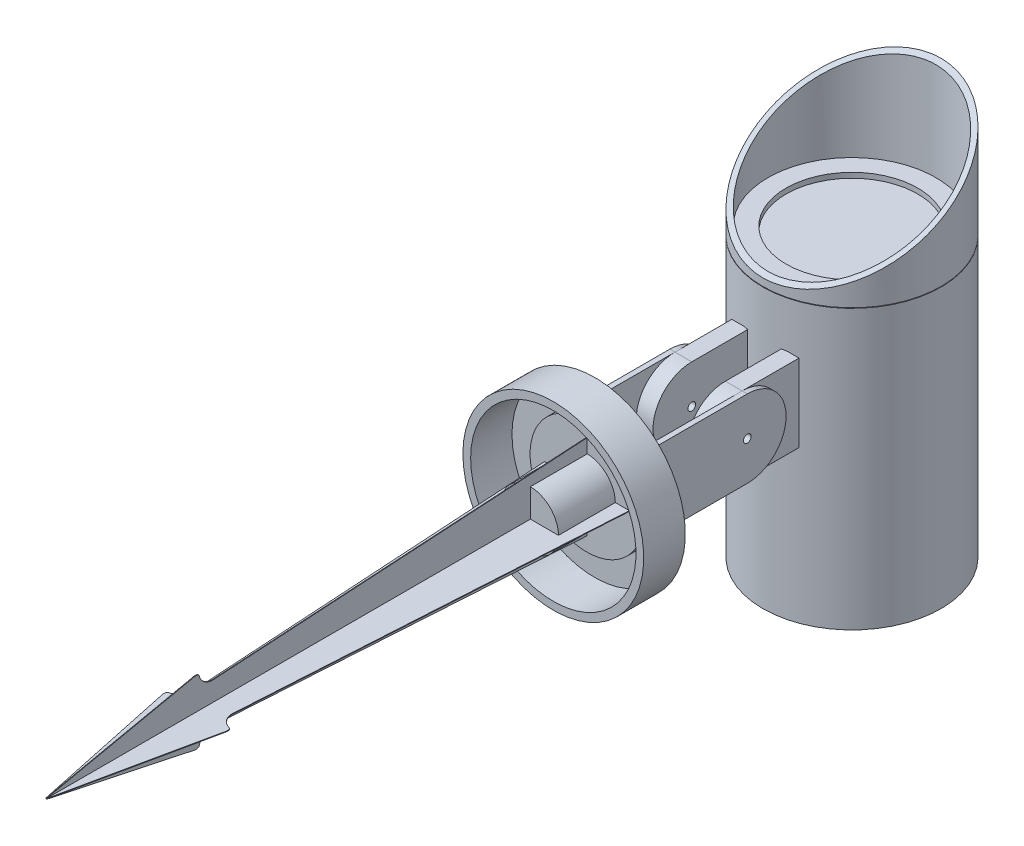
from build123d import *

# Parameters (mm, degrees)
CROQUIS1_R                    = 22
SALIENTE_EXTRUIR1_DEPTH       = 3
CROQUIS3_R                    = 11
SALIENTE_EXTRUIR2_DEPTH       = 22
SALIENTE_EXTRUIR3_DEPTH       = 0.125
MATRIZC1_COUNT                = 4
CROQUIS5_R                    = 35
CROQUIS5_R_2                  = 32
SALIENTE_EXTRUIR5_DEPTH       = 16
CROQUIS6_R                    = 35
SALIENTE_EXTRUIR6_DEPTH       = 0.1
CROQUIS7_W                    = 30
CROQUIS7_H                    = 30
SALIENTE_EXTRUIR7_DEPTH       = 2
SALIENTE_EXTRUIR8_DEPTH       = 2
SALIENTE_EXTRUIR9_DEPTH       = 6.5
CROQUIS12_R                   = 1.5
CORTAR_EXTRUIR1_DEPTH         = 221.83849469
SALIENTE_EXTRUIR10_DEPTH      = 75
SALIENTE_EXTRUIR10_DEPTH_BACK = 75
CROQUIS13_R                   = 34.5
CROQUIS14_R                   = 32.5
CORTAR_EXTRUIR2_DEPTH         = 39
CORTAR_EXTRUIR3_DEPTH         = 228.803952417
CORTAR_EXTRUIR3_DEPTH_BACK    = 228.803952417
CROQUIS16_R                   = 25.5
CORTAR_EXTRUIR4_DEPTH         = 2
CROQUIS17_R                   = 34.5
CROQUIS17_R_2                 = 32.5
CORTAR_EXTRUIR5_DEPTH         = 0.2


with BuildPart() as part:
    # Croquis1 → Saliente-Extruir1 (new body)
    with BuildSketch(Plane.XY):
        Circle(CROQUIS1_R)
    extrude(amount=SALIENTE_EXTRUIR1_DEPTH)

    # Croquis3 → Saliente-Extruir2 (add)
    with BuildSketch(Plane.XY.offset(3)):
        Circle(CROQUIS3_R)
    extrude(amount=SALIENTE_EXTRUIR2_DEPTH)

    # Croquis4 → Saliente-Extruir3 (add, symmetric)
    with BuildSketch(Plane(origin=(0, 0, 0), x_dir=(1, 0, 0), z_dir=(0, 1, 0))):
        with BuildLine():
            Line((-16.438389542, -3), (16.438389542, -3))
            Line((16.438389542, -3), (7.650010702, -147.998401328))
            ThreePointArc((7.650010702, -147.998401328), (8.754363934, -151.251708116), (11.610998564, -153.160435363))
            ThreePointArc((11.610998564, -153.160435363), (12.100186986, -153.462666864), (12.342048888, -153.984348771))
            ThreePointArc((12.342048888, -153.984348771), (12.358637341, -154.898924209), (12.149581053, -155.789440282))
            Line((12.149581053, -155.789440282), (0.195637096, -212.078774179))
            ThreePointArc((0.195637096, -212.078774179), (0, -212.2372275), (-0.195637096, -212.078774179))
            Line((-0.195637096, -212.078774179), (-12.149581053, -155.789440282))
            ThreePointArc((-12.149581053, -155.789440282), (-12.358637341, -154.898924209), (-12.342048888, -153.984348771))
            ThreePointArc((-12.342048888, -153.984348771), (-12.100186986, -153.462666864), (-11.610998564, -153.160435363))
            ThreePointArc((-11.610998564, -153.160435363), (-8.754363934, -151.251708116), (-7.650010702, -147.998401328))
            Line((-7.650010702, -147.998401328), (-16.438389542, -3))
        make_face()
    saliente_extruir3 = extrude(amount=SALIENTE_EXTRUIR3_DEPTH, both=True)

    # MatrizC1: Saliente-Extruir3 ×4 about axis
    matrizc1_axis = Axis((0, 0, 0), (0, 0, 1))
    for i in range(1, MATRIZC1_COUNT):
        add(saliente_extruir3.rotate(matrizc1_axis, i * 360 / MATRIZC1_COUNT))



with BuildPart() as body_2:
    # Croquis5 → Saliente-Extruir5 (new body)
    with BuildSketch(Plane(origin=(0, 0, 0), x_dir=(-1, 0, 0), z_dir=(0, 0, -1))):
        Circle(CROQUIS5_R)
        Circle(CROQUIS5_R_2, mode=Mode.SUBTRACT)
    extrude(amount=-SALIENTE_EXTRUIR5_DEPTH)


with BuildPart() as part_1:
    add(part.part)

    add(body_2.part)  # Saliente-Extruir6 merges body 2
    # Croquis6 → Saliente-Extruir6 (add)
    with BuildSketch(Plane(origin=(0, 0, 0), x_dir=(-1, 0, 0), z_dir=(0, 0, -1))):
        Circle(CROQUIS6_R)
    extrude(amount=SALIENTE_EXTRUIR6_DEPTH)

    # Croquis7 → Saliente-Extruir7 (add)
    with BuildSketch(Plane(origin=(0, 0, -0.1), x_dir=(-1, 0, 0), z_dir=(0, 0, -1))):
        Rectangle(CROQUIS7_W, CROQUIS7_H)
    extrude(amount=SALIENTE_EXTRUIR7_DEPTH)

    # Croquis9 → Saliente-Extruir8 (add)
    with BuildSketch(Plane.ZY.offset(15)):
        with BuildLine():
            Line((-2.1, 15), (-44.1, 15))
            ThreePointArc((-44.1, 15), (-59.1, 0), (-44.1, -15))
            Line((-44.1, -15), (-2.1, -15))
            Line((-2.1, -15), (-2.1, 15))
        make_face()
    saliente_extruir8 = extrude(amount=-SALIENTE_EXTRUIR8_DEPTH)

    # Simetr_a2: Saliente-Extruir8 across plane
    add(saliente_extruir8.mirror(Plane(origin=(0, 0, 0), x_dir=(0, 0, 1), z_dir=(1, 0, 0))))

    # Croquis11 → Saliente-Extruir9 (add)
    with BuildSketch(Plane(origin=(-13, 0, 0), x_dir=(0, 0, -1), z_dir=(1, 0, 0))):
        with BuildLine():
            Line((44.1, 15), (66.1, 15))
            Line((66.1, 15), (66.1, -15))
            Line((66.1, -15), (44.1, -15))
            ThreePointArc((44.1, -15), (29.1, 0), (44.1, 15))
        make_face()
    saliente_extruir9 = extrude(amount=SALIENTE_EXTRUIR9_DEPTH)

    # Simetr_a3: Saliente-Extruir9 across plane
    add(saliente_extruir9.mirror(Plane(origin=(0, 0, 0), x_dir=(0, 0, 1), z_dir=(1, 0, 0))))

    # Croquis12 → Cortar-Extruir1 (cut, through all)
    with BuildSketch(Plane.ZY.offset(15)):
        with Locations((-44.1, 0)):
            Circle(CROQUIS12_R)
    extrude(amount=-CORTAR_EXTRUIR1_DEPTH, mode=Mode.SUBTRACT)

    # Croquis13 → Saliente-Extruir10 (add, two sides: drawn at the far end of the back side and taken through both)
    with BuildSketch(Plane(origin=(0, 0, 0), x_dir=(1, 0, 0), z_dir=(0, 1, 0)).offset(-SALIENTE_EXTRUIR10_DEPTH_BACK)):
        with Locations(Location((0, 99.6, 0), (0, 0, 270))):
            Circle(CROQUIS13_R)
    extrude(amount=SALIENTE_EXTRUIR10_DEPTH + SALIENTE_EXTRUIR10_DEPTH_BACK)

    # Croquis14 → Cortar-Extruir2 (cut)
    with BuildSketch(Plane(origin=(0, 75, 0), x_dir=(1, 0, 0), z_dir=(0, 1, 0))):
        with Locations(Location((0, 99.6, 0), (0, 0, 270))):
            Circle(CROQUIS14_R)
    extrude(amount=-CORTAR_EXTRUIR2_DEPTH, mode=Mode.SUBTRACT)

    # Croquis15 → Cortar-Extruir3 (cut, two sides: drawn at the far end of the back side and taken through both)
    with BuildSketch(Plane(origin=(0, 0, 0), x_dir=(0, 0, -1), z_dir=(1, 0, 0)).offset(-CORTAR_EXTRUIR3_DEPTH_BACK)):
        Polygon((134.1, 75), (65.1, 35.893911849), (44.6810015, 81.483879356), (146.011827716, 91.812856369), align=None)
    extrude(amount=CORTAR_EXTRUIR3_DEPTH + CORTAR_EXTRUIR3_DEPTH_BACK, mode=Mode.SUBTRACT)

    # Croquis16 → Cortar-Extruir4 (cut)
    with BuildSketch(Plane(origin=(0, 36, 0), x_dir=(1, 0, 0), z_dir=(0, 1, 0))):
        with Locations(Location((0, 99.6, 0), (0, 0, 270))):
            Circle(CROQUIS16_R)
    extrude(amount=-CORTAR_EXTRUIR4_DEPTH, mode=Mode.SUBTRACT)

    # Croquis17 → Cortar-Extruir5 (cut)
    with BuildSketch(Plane(origin=(0, 33, 0), x_dir=(1, 0, 0), z_dir=(0, 1, 0))):
        with Locations(Location((0, 99.6, 0), (0, 0, 270))):
            Circle(CROQUIS17_R)
        with Locations(Location((0, 99.6, 0), (0, 0, 270))):
            Circle(CROQUIS17_R_2, mode=Mode.SUBTRACT)
    extrude(amount=-CORTAR_EXTRUIR5_DEPTH, mode=Mode.SUBTRACT)


solid = part_1.part
